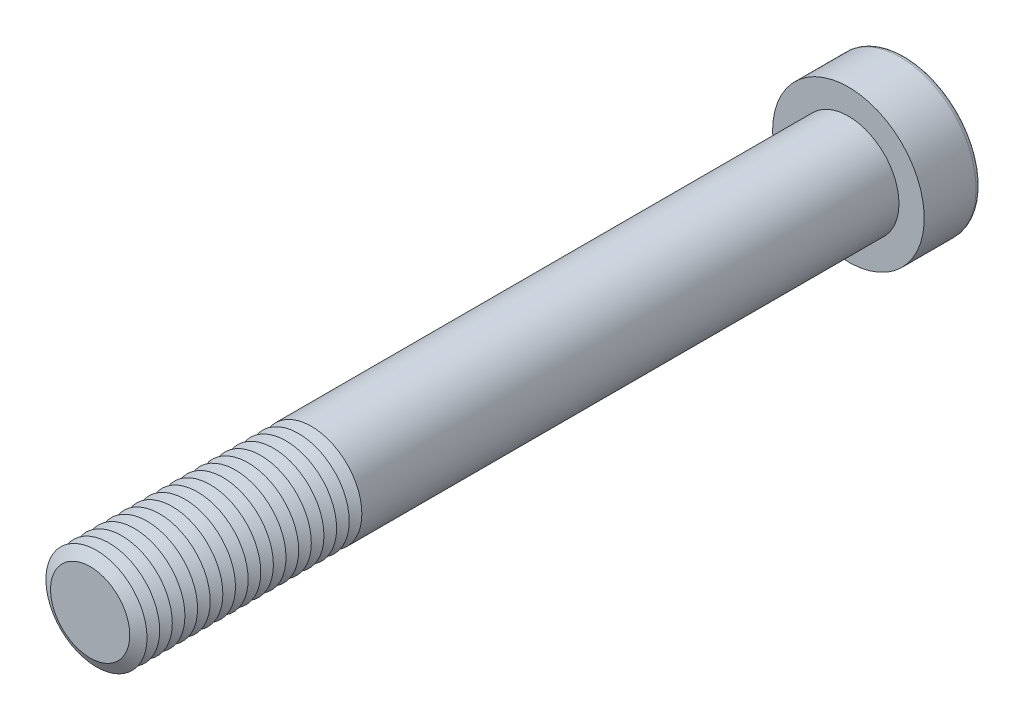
from build123d import *

# Parameters (mm, degrees)
SKETCH1_R           = 8
BOSS_EXTRUDE1_DEPTH = 120
SKETCH2_R           = 12
BOSS_EXTRUDE2_DEPTH = 9
CUT_EXTRUDE1_DEPTH  = 9
FILLET1_R           = 0.8
LPATTERN1_COUNT     = 18
LPATTERN1_PITCH     = 2


with BuildPart() as part:
    # Sketch1 → Boss-Extrude1 (new body)
    with BuildSketch(Plane.XY):
        Circle(SKETCH1_R)
    extrude(amount=BOSS_EXTRUDE1_DEPTH)

    # Sketch2 → Boss-Extrude2 (add)
    with BuildSketch(Plane(origin=(0, 0, 0), x_dir=(-1, 0, 0), z_dir=(0, 0, -1))):
        Circle(SKETCH2_R)
    extrude(amount=BOSS_EXTRUDE2_DEPTH)

    # Sketch3 → Cut-Extrude1 (cut)
    with BuildSketch(Plane(origin=(0, 0, -9), x_dir=(-1, 0, 0), z_dir=(0, 0, -1))):
        Polygon((-3.464101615, 6), (-6.92820323, 0), (-3.464101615, -6), (3.464101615, -6), (6.92820323, 0), (3.464101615, 6), align=None)
    extrude(amount=-CUT_EXTRUDE1_DEPTH, mode=Mode.SUBTRACT)

    # Fillet1
    fillet1_edges = [part.edges().sort_by_distance(p)[0] for p in [
        (12, 0, -9),
    ]]
    fillet(fillet1_edges, radius=FILLET1_R)

    # Cut-Extrude2 cone 1 section (on through the dimple's axis) → Cut-Extrude2 (revolve, cut)
    with BuildSketch(Plane.YZ):
        Polygon((0, 0), (6, 0), (0, 3.464101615), align=None)
    revolve(axis=Axis((0, 0, 0), (0, 0, 1)), mode=Mode.SUBTRACT)

    # Cut-Extrude3 cone 1 section (on through the dimple's axis) → Cut-Extrude3 (revolve, cut)
    with BuildSketch(Plane(origin=(0, 0, -9), x_dir=(0, 1, 0), z_dir=(1, 0, 0))):
        Polygon((0, 0), (6.92820323, 0), (0, 1.856406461), align=None)
    revolve(axis=Axis((0, 0, -9), (0, 0, 1)), mode=Mode.SUBTRACT)

    # Sketch7 → Cut-Revolve1 (revolve, cut)
    with BuildSketch(Plane(origin=(0, 0, 0), x_dir=(0, 0, -1), z_dir=(1, 0, 0)), mode=Mode.PRIVATE) as cut_revolve1_sk:
        Polygon((-120, 6.267949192), (-119, 8), (-121, 8), align=None)
    cut_revolve1 = revolve(cut_revolve1_sk.sketch.rotate(Axis((0, 0, 120), (0, 0, -1)), 90), axis=Axis((0, 0, 120), (0, 0, -1)), mode=Mode.SUBTRACT)

    # LPattern1: Cut-Revolve1 ×18
    with Locations(*[(0, 0, -i * LPATTERN1_PITCH) for i in range(1, LPATTERN1_COUNT)]):
        add(cut_revolve1, mode=Mode.SUBTRACT)


solid = part.part
